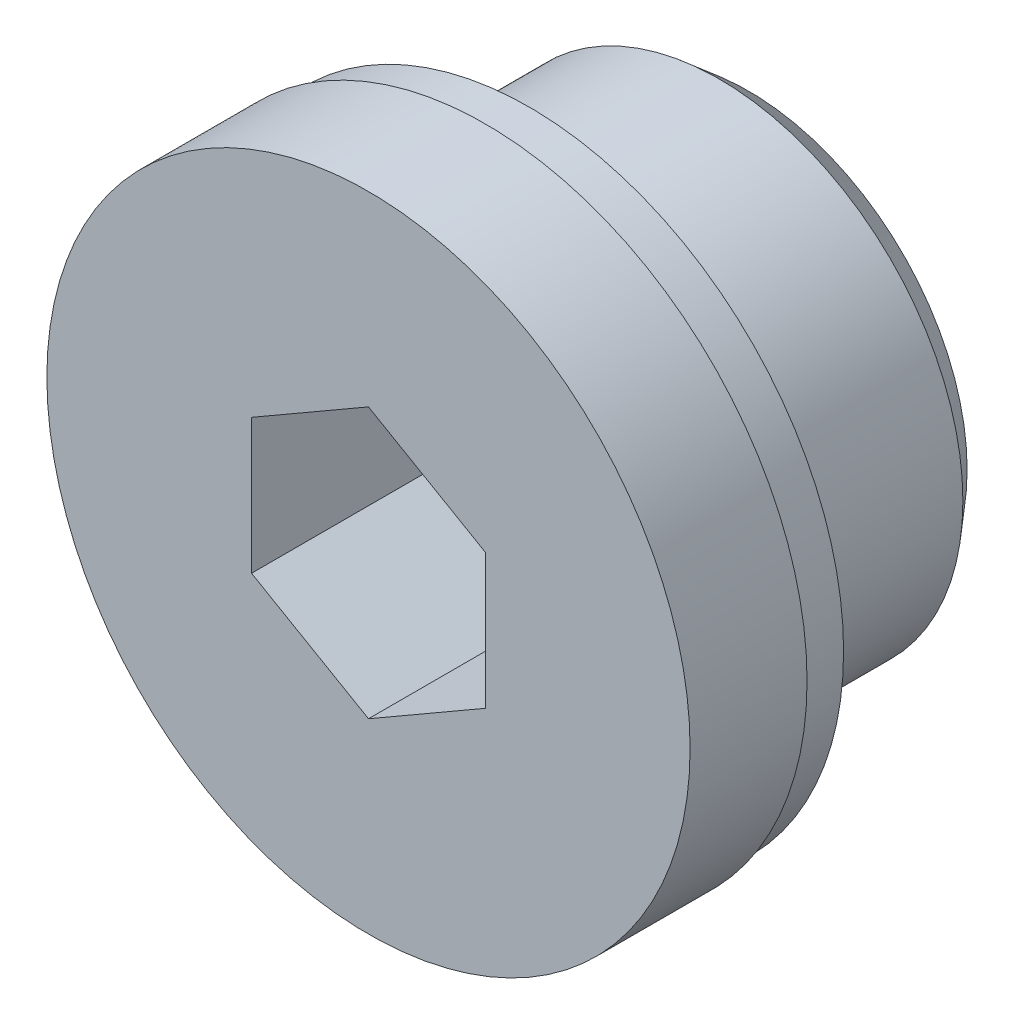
ISO-10303-21;
HEADER;
FILE_DESCRIPTION(('STEP AP214'),'2;1');
FILE_NAME('part.step','',(''),(''),'','','');
FILE_SCHEMA(('AUTOMOTIVE_DESIGN { 1 0 10303 214 1 1 1 1 }'));
ENDSEC;
DATA;
#1=APPLICATION_CONTEXT('core data for automotive mechanical design processes');
#2=APPLICATION_PROTOCOL_DEFINITION('international standard','automotive_design',2000,#1);
#3=PRODUCT_CONTEXT('',#1,'mechanical');
#4=PRODUCT('Part','Part','',(#3));
#5=PRODUCT_RELATED_PRODUCT_CATEGORY('part','',(#4));
#6=PRODUCT_DEFINITION_FORMATION('','',#4);
#7=PRODUCT_DEFINITION_CONTEXT('part definition',#1,'design');
#8=PRODUCT_DEFINITION('design','',#6,#7);
#9=PRODUCT_DEFINITION_SHAPE('','',#8);
#10=(LENGTH_UNIT() NAMED_UNIT(*) SI_UNIT(.MILLI.,.METRE.));
#11=(NAMED_UNIT(*) PLANE_ANGLE_UNIT() SI_UNIT($,.RADIAN.));
#12=(NAMED_UNIT(*) SI_UNIT($,.STERADIAN.) SOLID_ANGLE_UNIT());
#13=UNCERTAINTY_MEASURE_WITH_UNIT(LENGTH_MEASURE(1.E-05),#10,'distance_accuracy_value','');
#14=(GEOMETRIC_REPRESENTATION_CONTEXT(3) GLOBAL_UNCERTAINTY_ASSIGNED_CONTEXT((#13)) GLOBAL_UNIT_ASSIGNED_CONTEXT((#10,
#11,#12)) REPRESENTATION_CONTEXT('',''));
#15=CARTESIAN_POINT('',(0.,0.,0.));
#16=DIRECTION('',(0.,0.,1.));
#17=DIRECTION('',(1.,0.,0.));
#18=AXIS2_PLACEMENT_3D('',#15,#16,#17);
#19=CARTESIAN_POINT('',(0.,0.,0.));
#20=DIRECTION('',(0.,0.,1.));
#21=DIRECTION('',(1.,0.,0.));
#22=AXIS2_PLACEMENT_3D('',#19,#20,#21);
#23=CYLINDRICAL_SURFACE('',#22,10.75);
#24=CARTESIAN_POINT('',(0.,0.,1.50000000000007));
#25=DIRECTION('',(0.,0.,1.));
#26=DIRECTION('',(1.,0.,0.));
#27=AXIS2_PLACEMENT_3D('',#24,#25,#26);
#28=CIRCLE('',#27,10.75);
#29=CARTESIAN_POINT('',(10.75,0.,1.50000000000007));
#30=VERTEX_POINT('',#29);
#31=EDGE_CURVE('E116',#30,#30,#28,.T.);
#32=ORIENTED_EDGE('',*,*,#31,.F.);
#33=EDGE_LOOP('',(#32));
#34=FACE_BOUND('',#33,.T.);
#35=CARTESIAN_POINT('',(0.,0.,0.));
#36=DIRECTION('',(0.,0.,1.));
#37=DIRECTION('',(1.,0.,0.));
#38=AXIS2_PLACEMENT_3D('',#35,#36,#37);
#39=CIRCLE('',#38,10.75);
#40=CARTESIAN_POINT('',(10.75,0.,0.));
#41=VERTEX_POINT('',#40);
#42=EDGE_CURVE('E9',#41,#41,#39,.T.);
#43=ORIENTED_EDGE('',*,*,#42,.T.);
#44=EDGE_LOOP('',(#43));
#45=FACE_BOUND('',#44,.T.);
#46=ADVANCED_FACE('F14',(#34,#45),#23,.T.);
#47=CARTESIAN_POINT('',(0.,-10.75,0.));
#48=DIRECTION('',(0.,0.,1.));
#49=DIRECTION('',(1.,0.,0.));
#50=AXIS2_PLACEMENT_3D('',#47,#48,#49);
#51=PLANE('',#50);
#52=ORIENTED_EDGE('',*,*,#42,.F.);
#53=EDGE_LOOP('',(#52));
#54=FACE_BOUND('',#53,.T.);
#55=CARTESIAN_POINT('',(0.,0.,0.));
#56=DIRECTION('',(0.,0.,1.));
#57=DIRECTION('',(1.,0.,0.));
#58=AXIS2_PLACEMENT_3D('',#55,#56,#57);
#59=CIRCLE('',#58,8.33);
#60=CARTESIAN_POINT('',(8.33,0.,0.));
#61=VERTEX_POINT('',#60);
#62=EDGE_CURVE('E21',#61,#61,#59,.T.);
#63=ORIENTED_EDGE('',*,*,#62,.T.);
#64=EDGE_LOOP('',(#63));
#65=FACE_BOUND('',#64,.T.);
#66=ADVANCED_FACE('F139',(#54,#65),#51,.F.);
#67=CARTESIAN_POINT('',(0.,0.,0.));
#68=DIRECTION('',(0.,0.,1.));
#69=DIRECTION('',(1.,0.,0.));
#70=AXIS2_PLACEMENT_3D('',#67,#68,#69);
#71=CYLINDRICAL_SURFACE('',#70,8.33);
#72=ORIENTED_EDGE('',*,*,#62,.F.);
#73=EDGE_LOOP('',(#72));
#74=FACE_BOUND('',#73,.T.);
#75=CARTESIAN_POINT('',(0.,0.,-6.5));
#76=DIRECTION('',(0.,0.,1.));
#77=DIRECTION('',(1.,0.,0.));
#78=AXIS2_PLACEMENT_3D('',#75,#76,#77);
#79=CIRCLE('',#78,8.33);
#80=CARTESIAN_POINT('',(8.33,0.,-6.5));
#81=VERTEX_POINT('',#80);
#82=EDGE_CURVE('E134',#81,#81,#79,.T.);
#83=ORIENTED_EDGE('',*,*,#82,.T.);
#84=EDGE_LOOP('',(#83));
#85=FACE_BOUND('',#84,.T.);
#86=ADVANCED_FACE('F141',(#74,#85),#71,.T.);
#87=CARTESIAN_POINT('',(0.,0.,-7.5));
#88=DIRECTION('',(0.,0.,1.));
#89=DIRECTION('',(1.,0.,0.));
#90=AXIS2_PLACEMENT_3D('',#87,#88,#89);
#91=CONICAL_SURFACE('',#90,7.47500000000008,0.707389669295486);
#92=ORIENTED_EDGE('',*,*,#82,.F.);
#93=EDGE_LOOP('',(#92));
#94=FACE_BOUND('',#93,.T.);
#95=CARTESIAN_POINT('',(0.,0.,-7.5));
#96=DIRECTION('',(0.,0.,1.));
#97=DIRECTION('',(1.,0.,0.));
#98=AXIS2_PLACEMENT_3D('',#95,#96,#97);
#99=CIRCLE('',#98,7.47500000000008);
#100=CARTESIAN_POINT('',(7.47500000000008,0.,-7.5));
#101=VERTEX_POINT('',#100);
#102=EDGE_CURVE('E131',#101,#101,#99,.T.);
#103=ORIENTED_EDGE('',*,*,#102,.T.);
#104=EDGE_LOOP('',(#103));
#105=FACE_BOUND('',#104,.T.);
#106=ADVANCED_FACE('F144',(#94,#105),#91,.T.);
#107=CARTESIAN_POINT('',(0.,-7.47500000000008,-7.5));
#108=DIRECTION('',(0.,0.,1.));
#109=DIRECTION('',(1.,0.,0.));
#110=AXIS2_PLACEMENT_3D('',#107,#108,#109);
#111=PLANE('',#110);
#112=ORIENTED_EDGE('',*,*,#102,.F.);
#113=EDGE_LOOP('',(#112));
#114=FACE_BOUND('',#113,.T.);
#115=ADVANCED_FACE('F150',(#114),#111,.F.);
#116=CARTESIAN_POINT('',(0.,0.,5.5));
#117=DIRECTION('',(0.,0.,-1.));
#118=DIRECTION('',(-1.,0.,0.));
#119=AXIS2_PLACEMENT_3D('',#116,#117,#118);
#120=PLANE('',#119);
#121=DIRECTION('',(-0.866025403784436,-0.5,0.));
#122=VECTOR('',#121,1.);
#123=CARTESIAN_POINT('',(0.,4.61880215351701,5.5));
#124=LINE('',#123,#122);
#125=CARTESIAN_POINT('',(0.,4.61880215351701,5.5));
#126=VERTEX_POINT('',#125);
#127=CARTESIAN_POINT('',(-4.,2.30940107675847,5.5));
#128=VERTEX_POINT('',#127);
#129=EDGE_CURVE('E82',#126,#128,#124,.T.);
#130=ORIENTED_EDGE('',*,*,#129,.F.);
#131=DIRECTION('',(-0.866025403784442,0.5,0.));
#132=VECTOR('',#131,1.);
#133=CARTESIAN_POINT('',(4.,2.30940107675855,5.5));
#134=LINE('',#133,#132);
#135=CARTESIAN_POINT('',(4.,2.30940107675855,5.5));
#136=VERTEX_POINT('',#135);
#137=EDGE_CURVE('E28',#136,#126,#134,.T.);
#138=ORIENTED_EDGE('',*,*,#137,.F.);
#139=DIRECTION('',(0.,1.,0.));
#140=VECTOR('',#139,1.);
#141=CARTESIAN_POINT('',(4.,-2.30940107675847,5.5));
#142=LINE('',#141,#140);
#143=CARTESIAN_POINT('',(4.,-2.30940107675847,5.5));
#144=VERTEX_POINT('',#143);
#145=EDGE_CURVE('E98',#144,#136,#142,.T.);
#146=ORIENTED_EDGE('',*,*,#145,.F.);
#147=DIRECTION('',(0.866025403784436,0.5,0.));
#148=VECTOR('',#147,1.);
#149=CARTESIAN_POINT('',(0.,-4.61880215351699,5.5));
#150=LINE('',#149,#148);
#151=CARTESIAN_POINT('',(0.,-4.61880215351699,5.5));
#152=VERTEX_POINT('',#151);
#153=EDGE_CURVE('E92',#152,#144,#150,.T.);
#154=ORIENTED_EDGE('',*,*,#153,.F.);
#155=DIRECTION('',(0.866025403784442,-0.5,0.));
#156=VECTOR('',#155,1.);
#157=CARTESIAN_POINT('',(-4.,-2.30940107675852,5.5));
#158=LINE('',#157,#156);
#159=CARTESIAN_POINT('',(-4.,-2.30940107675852,5.5));
#160=VERTEX_POINT('',#159);
#161=EDGE_CURVE('E90',#160,#152,#158,.T.);
#162=ORIENTED_EDGE('',*,*,#161,.F.);
#163=DIRECTION('',(0.,-1.,0.));
#164=VECTOR('',#163,1.);
#165=CARTESIAN_POINT('',(-4.,2.30940107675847,5.5));
#166=LINE('',#165,#164);
#167=EDGE_CURVE('E71',#128,#160,#166,.T.);
#168=ORIENTED_EDGE('',*,*,#167,.F.);
#169=EDGE_LOOP('',(#130,#138,#146,#154,#162,#168));
#170=FACE_BOUND('',#169,.T.);
#171=CARTESIAN_POINT('',(0.,0.,5.50000000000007));
#172=DIRECTION('',(0.,0.,1.));
#173=DIRECTION('',(1.,0.,0.));
#174=AXIS2_PLACEMENT_3D('',#171,#172,#173);
#175=CIRCLE('',#174,11.);
#176=CARTESIAN_POINT('',(11.,0.,5.50000000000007));
#177=VERTEX_POINT('',#176);
#178=EDGE_CURVE('E128',#177,#177,#175,.T.);
#179=ORIENTED_EDGE('',*,*,#178,.T.);
#180=EDGE_LOOP('',(#179));
#181=FACE_BOUND('',#180,.T.);
#182=ADVANCED_FACE('F86',(#170,#181),#120,.F.);
#183=CARTESIAN_POINT('',(0.,0.,0.));
#184=DIRECTION('',(0.,0.,1.));
#185=DIRECTION('',(1.,0.,0.));
#186=AXIS2_PLACEMENT_3D('',#183,#184,#185);
#187=CYLINDRICAL_SURFACE('',#186,11.);
#188=ORIENTED_EDGE('',*,*,#178,.F.);
#189=EDGE_LOOP('',(#188));
#190=FACE_BOUND('',#189,.T.);
#191=CARTESIAN_POINT('',(0.,0.,1.50000000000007));
#192=DIRECTION('',(0.,0.,1.));
#193=DIRECTION('',(1.,0.,0.));
#194=AXIS2_PLACEMENT_3D('',#191,#192,#193);
#195=CIRCLE('',#194,11.);
#196=CARTESIAN_POINT('',(11.,0.,1.50000000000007));
#197=VERTEX_POINT('',#196);
#198=EDGE_CURVE('E125',#197,#197,#195,.T.);
#199=ORIENTED_EDGE('',*,*,#198,.T.);
#200=EDGE_LOOP('',(#199));
#201=FACE_BOUND('',#200,.T.);
#202=ADVANCED_FACE('F161',(#190,#201),#187,.T.);
#203=CARTESIAN_POINT('',(0.,-11.,1.50000000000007));
#204=DIRECTION('',(0.,0.,1.));
#205=DIRECTION('',(1.,0.,0.));
#206=AXIS2_PLACEMENT_3D('',#203,#204,#205);
#207=PLANE('',#206);
#208=ORIENTED_EDGE('',*,*,#198,.F.);
#209=EDGE_LOOP('',(#208));
#210=FACE_BOUND('',#209,.T.);
#211=ORIENTED_EDGE('',*,*,#31,.T.);
#212=EDGE_LOOP('',(#211));
#213=FACE_BOUND('',#212,.T.);
#214=ADVANCED_FACE('F174',(#210,#213),#207,.F.);
#215=CARTESIAN_POINT('',(4.,2.30940107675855,-2.5));
#216=DIRECTION('',(0.5,0.866025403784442,0.));
#217=DIRECTION('',(-0.866025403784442,0.5,0.));
#218=AXIS2_PLACEMENT_3D('',#215,#216,#217);
#219=PLANE('',#218);
#220=ORIENTED_EDGE('',*,*,#137,.T.);
#221=DIRECTION('',(0.,0.,1.));
#222=VECTOR('',#221,1.);
#223=CARTESIAN_POINT('',(0.,4.61880215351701,-2.5));
#224=LINE('',#223,#222);
#225=CARTESIAN_POINT('',(0.,4.61880215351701,-2.5));
#226=VERTEX_POINT('',#225);
#227=EDGE_CURVE('E79',#226,#126,#224,.T.);
#228=ORIENTED_EDGE('',*,*,#227,.F.);
#229=DIRECTION('',(-0.866025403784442,0.5,0.));
#230=VECTOR('',#229,1.);
#231=CARTESIAN_POINT('',(4.,2.30940107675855,-2.5));
#232=LINE('',#231,#230);
#233=CARTESIAN_POINT('',(4.,2.30940107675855,-2.5));
#234=VERTEX_POINT('',#233);
#235=EDGE_CURVE('E100',#234,#226,#232,.T.);
#236=ORIENTED_EDGE('',*,*,#235,.F.);
#237=DIRECTION('',(0.,0.,1.));
#238=VECTOR('',#237,1.);
#239=CARTESIAN_POINT('',(4.,2.30940107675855,-2.5));
#240=LINE('',#239,#238);
#241=EDGE_CURVE('E35',#234,#136,#240,.T.);
#242=ORIENTED_EDGE('',*,*,#241,.T.);
#243=EDGE_LOOP('',(#220,#228,#236,#242));
#244=FACE_BOUND('',#243,.T.);
#245=ADVANCED_FACE('F176',(#244),#219,.F.);
#246=CARTESIAN_POINT('',(4.,-2.30940107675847,-2.5));
#247=DIRECTION('',(1.,0.,0.));
#248=DIRECTION('',(0.,1.,0.));
#249=AXIS2_PLACEMENT_3D('',#246,#247,#248);
#250=PLANE('',#249);
#251=ORIENTED_EDGE('',*,*,#145,.T.);
#252=ORIENTED_EDGE('',*,*,#241,.F.);
#253=DIRECTION('',(0.,1.,0.));
#254=VECTOR('',#253,1.);
#255=CARTESIAN_POINT('',(4.,-2.30940107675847,-2.5));
#256=LINE('',#255,#254);
#257=CARTESIAN_POINT('',(4.,-2.30940107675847,-2.5));
#258=VERTEX_POINT('',#257);
#259=EDGE_CURVE('E112',#258,#234,#256,.T.);
#260=ORIENTED_EDGE('',*,*,#259,.F.);
#261=DIRECTION('',(0.,0.,1.));
#262=VECTOR('',#261,1.);
#263=CARTESIAN_POINT('',(4.,-2.30940107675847,-2.5));
#264=LINE('',#263,#262);
#265=EDGE_CURVE('E117',#258,#144,#264,.T.);
#266=ORIENTED_EDGE('',*,*,#265,.T.);
#267=EDGE_LOOP('',(#251,#252,#260,#266));
#268=FACE_BOUND('',#267,.T.);
#269=ADVANCED_FACE('F184',(#268),#250,.F.);
#270=CARTESIAN_POINT('',(0.,-4.61880215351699,-2.5));
#271=DIRECTION('',(0.5,-0.866025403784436,0.));
#272=DIRECTION('',(0.866025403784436,0.5,0.));
#273=AXIS2_PLACEMENT_3D('',#270,#271,#272);
#274=PLANE('',#273);
#275=ORIENTED_EDGE('',*,*,#153,.T.);
#276=ORIENTED_EDGE('',*,*,#265,.F.);
#277=DIRECTION('',(0.866025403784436,0.5,0.));
#278=VECTOR('',#277,1.);
#279=CARTESIAN_POINT('',(0.,-4.61880215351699,-2.5));
#280=LINE('',#279,#278);
#281=CARTESIAN_POINT('',(0.,-4.61880215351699,-2.5));
#282=VERTEX_POINT('',#281);
#283=EDGE_CURVE('E109',#282,#258,#280,.T.);
#284=ORIENTED_EDGE('',*,*,#283,.F.);
#285=DIRECTION('',(0.,0.,1.));
#286=VECTOR('',#285,1.);
#287=CARTESIAN_POINT('',(0.,-4.61880215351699,-2.5));
#288=LINE('',#287,#286);
#289=EDGE_CURVE('E119',#282,#152,#288,.T.);
#290=ORIENTED_EDGE('',*,*,#289,.T.);
#291=EDGE_LOOP('',(#275,#276,#284,#290));
#292=FACE_BOUND('',#291,.T.);
#293=ADVANCED_FACE('F198',(#292),#274,.F.);
#294=CARTESIAN_POINT('',(-4.,-2.30940107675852,-2.5));
#295=DIRECTION('',(-0.5,-0.866025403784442,0.));
#296=DIRECTION('',(0.866025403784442,-0.5,0.));
#297=AXIS2_PLACEMENT_3D('',#294,#295,#296);
#298=PLANE('',#297);
#299=ORIENTED_EDGE('',*,*,#161,.T.);
#300=ORIENTED_EDGE('',*,*,#289,.F.);
#301=DIRECTION('',(0.866025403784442,-0.5,0.));
#302=VECTOR('',#301,1.);
#303=CARTESIAN_POINT('',(-4.,-2.30940107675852,-2.5));
#304=LINE('',#303,#302);
#305=CARTESIAN_POINT('',(-4.,-2.30940107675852,-2.5));
#306=VERTEX_POINT('',#305);
#307=EDGE_CURVE('E106',#306,#282,#304,.T.);
#308=ORIENTED_EDGE('',*,*,#307,.F.);
#309=DIRECTION('',(0.,0.,1.));
#310=VECTOR('',#309,1.);
#311=CARTESIAN_POINT('',(-4.,-2.30940107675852,-2.5));
#312=LINE('',#311,#310);
#313=EDGE_CURVE('E78',#306,#160,#312,.T.);
#314=ORIENTED_EDGE('',*,*,#313,.T.);
#315=EDGE_LOOP('',(#299,#300,#308,#314));
#316=FACE_BOUND('',#315,.T.);
#317=ADVANCED_FACE('F195',(#316),#298,.F.);
#318=CARTESIAN_POINT('',(-4.,2.30940107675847,-2.5));
#319=DIRECTION('',(-1.,0.,0.));
#320=DIRECTION('',(0.,-1.,0.));
#321=AXIS2_PLACEMENT_3D('',#318,#319,#320);
#322=PLANE('',#321);
#323=ORIENTED_EDGE('',*,*,#167,.T.);
#324=ORIENTED_EDGE('',*,*,#313,.F.);
#325=DIRECTION('',(0.,-1.,0.));
#326=VECTOR('',#325,1.);
#327=CARTESIAN_POINT('',(-4.,2.30940107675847,-2.5));
#328=LINE('',#327,#326);
#329=CARTESIAN_POINT('',(-4.,2.30940107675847,-2.5));
#330=VERTEX_POINT('',#329);
#331=EDGE_CURVE('E74',#330,#306,#328,.T.);
#332=ORIENTED_EDGE('',*,*,#331,.F.);
#333=DIRECTION('',(0.,0.,1.));
#334=VECTOR('',#333,1.);
#335=CARTESIAN_POINT('',(-4.,2.30940107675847,-2.5));
#336=LINE('',#335,#334);
#337=EDGE_CURVE('E67',#330,#128,#336,.T.);
#338=ORIENTED_EDGE('',*,*,#337,.T.);
#339=EDGE_LOOP('',(#323,#324,#332,#338));
#340=FACE_BOUND('',#339,.T.);
#341=ADVANCED_FACE('F69',(#340),#322,.F.);
#342=CARTESIAN_POINT('',(0.,4.61880215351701,-2.5));
#343=DIRECTION('',(-0.5,0.866025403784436,0.));
#344=DIRECTION('',(-0.866025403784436,-0.5,0.));
#345=AXIS2_PLACEMENT_3D('',#342,#343,#344);
#346=PLANE('',#345);
#347=ORIENTED_EDGE('',*,*,#129,.T.);
#348=ORIENTED_EDGE('',*,*,#337,.F.);
#349=DIRECTION('',(-0.866025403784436,-0.5,0.));
#350=VECTOR('',#349,1.);
#351=CARTESIAN_POINT('',(0.,4.61880215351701,-2.5));
#352=LINE('',#351,#350);
#353=EDGE_CURVE('E103',#226,#330,#352,.T.);
#354=ORIENTED_EDGE('',*,*,#353,.F.);
#355=ORIENTED_EDGE('',*,*,#227,.T.);
#356=EDGE_LOOP('',(#347,#348,#354,#355));
#357=FACE_BOUND('',#356,.T.);
#358=ADVANCED_FACE('F83',(#357),#346,.F.);
#359=CARTESIAN_POINT('',(0.,4.61880215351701,-2.5));
#360=DIRECTION('',(0.,0.,1.));
#361=DIRECTION('',(1.,0.,0.));
#362=AXIS2_PLACEMENT_3D('',#359,#360,#361);
#363=PLANE('',#362);
#364=ORIENTED_EDGE('',*,*,#235,.T.);
#365=ORIENTED_EDGE('',*,*,#353,.T.);
#366=ORIENTED_EDGE('',*,*,#331,.T.);
#367=ORIENTED_EDGE('',*,*,#307,.T.);
#368=ORIENTED_EDGE('',*,*,#283,.T.);
#369=ORIENTED_EDGE('',*,*,#259,.T.);
#370=EDGE_LOOP('',(#364,#365,#366,#367,#368,#369));
#371=FACE_BOUND('',#370,.T.);
#372=ADVANCED_FACE('F192',(#371),#363,.T.);
#373=CLOSED_SHELL('',(#46,#66,#86,#106,#115,#182,#202,#214,#245,#269,#293,#317,#341,#358,#372));
#374=MANIFOLD_SOLID_BREP('B1',#373);
#375=ADVANCED_BREP_SHAPE_REPRESENTATION('',(#18,#374),#14);
#376=SHAPE_DEFINITION_REPRESENTATION(#9,#375);
ENDSEC;
END-ISO-10303-21;
